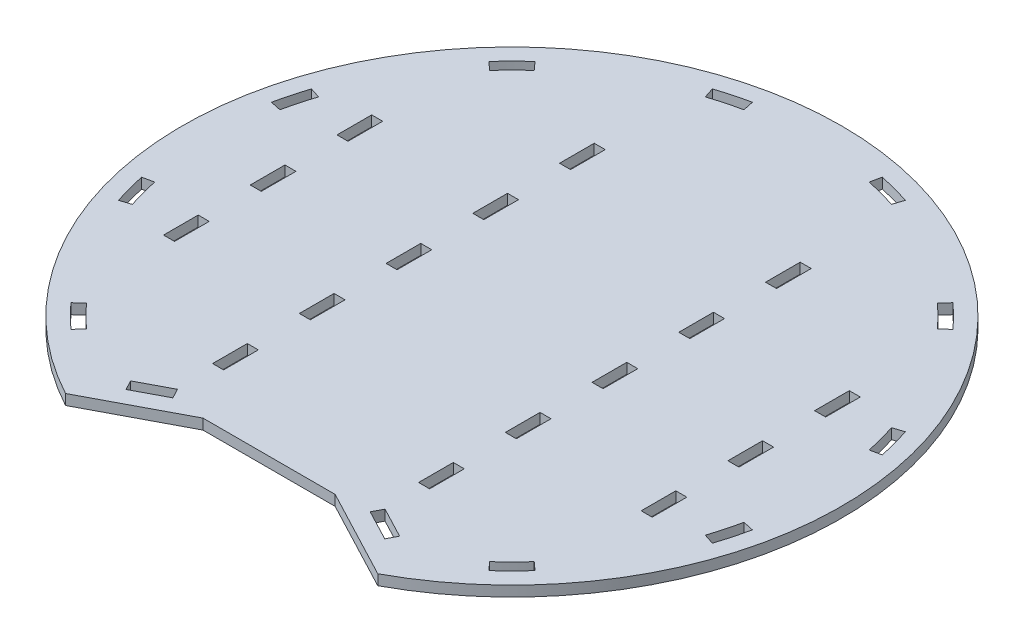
from build123d import *

# Parameters (mm, degrees)
SKETCH1_W           = 6.35
SKETCH1_H           = 20
BOSS_EXTRUDE1_DEPTH = 6


with BuildPart() as part:
    # Sketch1 → Boss-Extrude1 (new body)
    with BuildSketch(Plane(origin=(0, 0, 0), x_dir=(1, 0, 0), z_dir=(0, 1, 0))):
        with BuildLine():
            Line((-90, -167.332005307), (-38.1, -140))
            Line((-38.1, -140), (38.1, -140))
            Line((38.1, -140), (90, -167.332005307))
            ThreePointArc((90, -167.332005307), (0, 190), (-90, -167.332005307))
        make_face()
        with Locations((137.675, -50)):
            Rectangle(SKETCH1_W, SKETCH1_H, mode=Mode.SUBTRACT)
        with Locations((-137.675, 50)):
            Rectangle(SKETCH1_W, SKETCH1_H, mode=Mode.SUBTRACT)
        with Locations((-137.675, 0)):
            Rectangle(SKETCH1_W, SKETCH1_H, mode=Mode.SUBTRACT)
        with Locations((-137.675, -50)):
            Rectangle(SKETCH1_W, SKETCH1_H, mode=Mode.SUBTRACT)
        with Locations((137.675, 0)):
            Rectangle(SKETCH1_W, SKETCH1_H, mode=Mode.SUBTRACT)
        with Locations((137.675, 50)):
            Rectangle(SKETCH1_W, SKETCH1_H, mode=Mode.SUBTRACT)
        with BuildLine():
            Line((-53.660801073, 165.150964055), (-55.623058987, 171.190172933))
            ThreePointArc((-55.623058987, 171.190172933), (-46.587428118, 173.866648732), (-37.424104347, 176.066568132))
            Line((-37.424104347, 176.066568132), (-36.103865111, 169.855330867))
            ThreePointArc((-36.103865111, 169.855330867), (-44.943927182, 167.733019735), (-53.660801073, 165.150964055))
        make_face(mode=Mode.SUBTRACT)
        with BuildLine():
            Line((-120.443509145, 133.766068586), (-116.194529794, 129.047098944))
            ThreePointArc((-116.194529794, 129.047098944), (-122.789092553, 122.789092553), (-129.047098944, 116.194529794))
            Line((-129.047098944, 116.194529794), (-133.766068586, 120.443509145))
            ThreePointArc((-133.766068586, 120.443509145), (-127.279220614, 127.279220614), (-120.443509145, 133.766068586))
        make_face(mode=Mode.SUBTRACT)
        with BuildLine():
            Line((-171.190172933, 55.623058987), (-165.150964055, 53.660801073))
            ThreePointArc((-165.150964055, 53.660801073), (-167.733019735, 44.943927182), (-169.855330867, 36.103865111))
            Line((-169.855330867, 36.103865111), (-176.066568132, 37.424104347))
            ThreePointArc((-176.066568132, 37.424104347), (-173.866648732, 46.587428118), (-171.190172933, 55.623058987))
        make_face(mode=Mode.SUBTRACT)
        with BuildLine():
            Line((-176.066568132, -37.424104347), (-169.855330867, -36.103865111))
            ThreePointArc((-169.855330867, -36.103865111), (-167.733019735, -44.943927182), (-165.150964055, -53.660801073))
            Line((-165.150964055, -53.660801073), (-171.190172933, -55.623058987))
            ThreePointArc((-171.190172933, -55.623058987), (-173.866648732, -46.587428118), (-176.066568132, -37.424104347))
        make_face(mode=Mode.SUBTRACT)
        with BuildLine():
            Line((-133.766068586, -120.443509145), (-129.047098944, -116.194529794))
            ThreePointArc((-129.047098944, -116.194529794), (-122.789092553, -122.789092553), (-116.194529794, -129.047098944))
            Line((-116.194529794, -129.047098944), (-120.443509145, -133.766068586))
            ThreePointArc((-120.443509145, -133.766068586), (-127.279220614, -127.279220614), (-133.766068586, -120.443509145))
        make_face(mode=Mode.SUBTRACT)
        with Locations((59.378328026, 0)):
            Rectangle(SKETCH1_W, SKETCH1_H, mode=Mode.SUBTRACT)
        with BuildLine():
            Line((116.194529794, -129.047098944), (120.443509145, -133.766068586))
            ThreePointArc((120.443509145, -133.766068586), (127.279220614, -127.279220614), (133.766068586, -120.443509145))
            Line((133.766068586, -120.443509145), (129.047098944, -116.194529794))
            ThreePointArc((129.047098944, -116.194529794), (122.789092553, -122.789092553), (116.194529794, -129.047098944))
        make_face(mode=Mode.SUBTRACT)
        with BuildLine():
            Line((165.150964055, -53.660801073), (171.190172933, -55.623058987))
            ThreePointArc((171.190172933, -55.623058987), (173.866648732, -46.587428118), (176.066568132, -37.424104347))
            Line((176.066568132, -37.424104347), (169.855330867, -36.103865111))
            ThreePointArc((169.855330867, -36.103865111), (167.733019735, -44.943927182), (165.150964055, -53.660801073))
        make_face(mode=Mode.SUBTRACT)
        with BuildLine():
            Line((169.855330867, 36.103865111), (176.066568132, 37.424104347))
            ThreePointArc((176.066568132, 37.424104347), (173.866648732, 46.587428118), (171.190172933, 55.623058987))
            Line((171.190172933, 55.623058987), (165.150964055, 53.660801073))
            ThreePointArc((165.150964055, 53.660801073), (167.733019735, 44.943927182), (169.855330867, 36.103865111))
        make_face(mode=Mode.SUBTRACT)
        with BuildLine():
            Line((129.047098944, 116.194529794), (133.766068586, 120.443509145))
            ThreePointArc((133.766068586, 120.443509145), (127.279220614, 127.279220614), (120.443509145, 133.766068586))
            Line((120.443509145, 133.766068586), (116.194529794, 129.047098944))
            ThreePointArc((116.194529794, 129.047098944), (122.789092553, 122.789092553), (129.047098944, 116.194529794))
        make_face(mode=Mode.SUBTRACT)
        with BuildLine():
            Line((37.424104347, 176.066568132), (36.103865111, 169.855330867))
            ThreePointArc((36.103865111, 169.855330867), (44.943927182, 167.733019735), (53.660801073, 165.150964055))
            Line((53.660801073, 165.150964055), (55.623058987, 171.190172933))
            ThreePointArc((55.623058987, 171.190172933), (46.587428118, 173.866648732), (37.424104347, 176.066568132))
        make_face(mode=Mode.SUBTRACT)
        Polygon((-56.879281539, -138.587765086), (-59.838145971, -132.969258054), (-77.534231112, -142.288516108), (-74.57536668, -147.90702314), align=None, mode=Mode.SUBTRACT)
        Polygon((77.534231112, -142.288516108), (74.57536668, -147.90702314), (56.879281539, -138.587765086), (59.838145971, -132.969258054), align=None, mode=Mode.SUBTRACT)
        with Locations((-59.378328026, 50)):
            Rectangle(SKETCH1_W, SKETCH1_H, mode=Mode.SUBTRACT)
        with Locations((-59.378328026, 0)):
            Rectangle(SKETCH1_W, SKETCH1_H, mode=Mode.SUBTRACT)
        with Locations((-59.378328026, 100)):
            Rectangle(SKETCH1_W, SKETCH1_H, mode=Mode.SUBTRACT)
        with Locations((-59.378328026, -50)):
            Rectangle(SKETCH1_W, SKETCH1_H, mode=Mode.SUBTRACT)
        with Locations((-59.378328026, -100)):
            Rectangle(SKETCH1_W, SKETCH1_H, mode=Mode.SUBTRACT)
        with Locations((59.378328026, -50)):
            Rectangle(SKETCH1_W, SKETCH1_H, mode=Mode.SUBTRACT)
        with Locations((59.378328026, -100)):
            Rectangle(SKETCH1_W, SKETCH1_H, mode=Mode.SUBTRACT)
        with Locations((59.378328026, 100)):
            Rectangle(SKETCH1_W, SKETCH1_H, mode=Mode.SUBTRACT)
        with Locations((59.378328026, 50)):
            Rectangle(SKETCH1_W, SKETCH1_H, mode=Mode.SUBTRACT)
    extrude(amount=BOSS_EXTRUDE1_DEPTH)


solid = part.part
